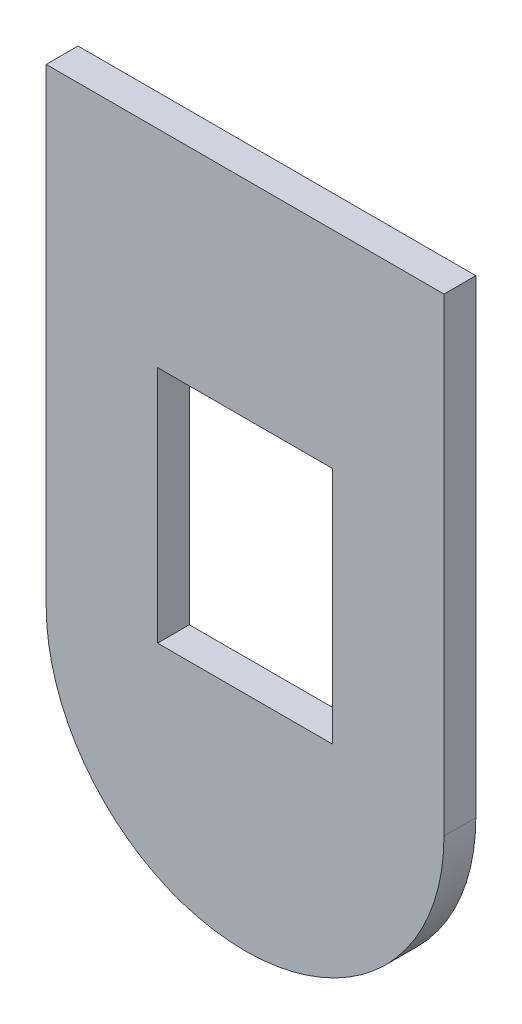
from build123d import *

# Parameters (mm, degrees)
ESQUISSE1_W      = 11
ESQUISSE1_H      = 15
EXTRUSION1_DEPTH = 2


with BuildPart() as part:
    # Esquisse1 → Extrusion1 (new body)
    with BuildSketch(Plane.XY):
        with BuildLine():
            Line((-12.5, -1), (-12.5, -30.5))
            ThreePointArc((-12.5, -30.5), (0, -43), (12.5, -30.5))
            Line((12.5, -30.5), (12.5, -1))
            Line((12.5, -1), (-12.5, -1))
        make_face()
        with Locations((0, -21.5)):
            Rectangle(ESQUISSE1_W, ESQUISSE1_H, mode=Mode.SUBTRACT)
    extrude(amount=EXTRUSION1_DEPTH)


solid = part.part
